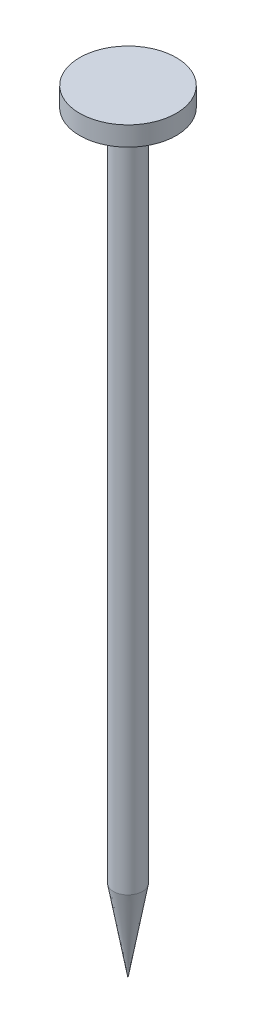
ISO-10303-21;
HEADER;
FILE_DESCRIPTION(('STEP AP214'),'2;1');
FILE_NAME('part.step','',(''),(''),'','','');
FILE_SCHEMA(('AUTOMOTIVE_DESIGN { 1 0 10303 214 1 1 1 1 }'));
ENDSEC;
DATA;
#1=APPLICATION_CONTEXT('core data for automotive mechanical design processes');
#2=APPLICATION_PROTOCOL_DEFINITION('international standard','automotive_design',2000,#1);
#3=PRODUCT_CONTEXT('',#1,'mechanical');
#4=PRODUCT('Part','Part','',(#3));
#5=PRODUCT_RELATED_PRODUCT_CATEGORY('part','',(#4));
#6=PRODUCT_DEFINITION_FORMATION('','',#4);
#7=PRODUCT_DEFINITION_CONTEXT('part definition',#1,'design');
#8=PRODUCT_DEFINITION('design','',#6,#7);
#9=PRODUCT_DEFINITION_SHAPE('','',#8);
#10=(LENGTH_UNIT() NAMED_UNIT(*) SI_UNIT(.MILLI.,.METRE.));
#11=(NAMED_UNIT(*) PLANE_ANGLE_UNIT() SI_UNIT($,.RADIAN.));
#12=(NAMED_UNIT(*) SI_UNIT($,.STERADIAN.) SOLID_ANGLE_UNIT());
#13=UNCERTAINTY_MEASURE_WITH_UNIT(LENGTH_MEASURE(1.E-05),#10,'distance_accuracy_value','');
#14=(GEOMETRIC_REPRESENTATION_CONTEXT(3) GLOBAL_UNCERTAINTY_ASSIGNED_CONTEXT((#13)) GLOBAL_UNIT_ASSIGNED_CONTEXT((#10,
#11,#12)) REPRESENTATION_CONTEXT('',''));
#15=CARTESIAN_POINT('',(0.,0.,0.));
#16=DIRECTION('',(0.,0.,1.));
#17=DIRECTION('',(1.,0.,0.));
#18=AXIS2_PLACEMENT_3D('',#15,#16,#17);
#19=CARTESIAN_POINT('',(0.,0.,0.));
#20=DIRECTION('',(0.,1.,0.));
#21=DIRECTION('',(0.,0.,1.));
#22=AXIS2_PLACEMENT_3D('',#19,#20,#21);
#23=CONICAL_SURFACE('',#22,0.,0.174532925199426);
#24=CARTESIAN_POINT('',(0.,4.25346136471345,0.));
#25=DIRECTION('',(0.,1.,0.));
#26=DIRECTION('',(0.,0.,1.));
#27=AXIS2_PLACEMENT_3D('',#24,#25,#26);
#28=CIRCLE('',#27,0.749999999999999);
#29=CARTESIAN_POINT('',(0.,4.25346136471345,0.749999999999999));
#30=VERTEX_POINT('',#29);
#31=EDGE_CURVE('E11',#30,#30,#28,.T.);
#32=ORIENTED_EDGE('',*,*,#31,.F.);
#33=EDGE_LOOP('',(#32));
#34=FACE_BOUND('',#33,.T.);
#35=CARTESIAN_POINT('',(0.,0.,0.));
#36=VERTEX_POINT('',#35);
#37=VERTEX_LOOP('',#36);
#38=FACE_BOUND('',#37,.T.);
#39=ADVANCED_FACE('F31',(#34,#38),#23,.T.);
#40=CARTESIAN_POINT('',(0.,0.,0.));
#41=DIRECTION('',(0.,1.,0.));
#42=DIRECTION('',(0.,0.,1.));
#43=AXIS2_PLACEMENT_3D('',#40,#41,#42);
#44=CYLINDRICAL_SURFACE('',#43,0.749999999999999);
#45=CARTESIAN_POINT('',(0.,39.,0.));
#46=DIRECTION('',(0.,1.,0.));
#47=DIRECTION('',(0.,0.,1.));
#48=AXIS2_PLACEMENT_3D('',#45,#46,#47);
#49=CIRCLE('',#48,0.749999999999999);
#50=CARTESIAN_POINT('',(0.,39.,0.749999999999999));
#51=VERTEX_POINT('',#50);
#52=EDGE_CURVE('E37',#51,#51,#49,.T.);
#53=ORIENTED_EDGE('',*,*,#52,.F.);
#54=EDGE_LOOP('',(#53));
#55=FACE_BOUND('',#54,.T.);
#56=ORIENTED_EDGE('',*,*,#31,.T.);
#57=EDGE_LOOP('',(#56));
#58=FACE_BOUND('',#57,.T.);
#59=ADVANCED_FACE('F41',(#55,#58),#44,.T.);
#60=CARTESIAN_POINT('',(0.749999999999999,39.,0.));
#61=DIRECTION('',(0.,1.,0.));
#62=DIRECTION('',(0.,0.,1.));
#63=AXIS2_PLACEMENT_3D('',#60,#61,#62);
#64=PLANE('',#63);
#65=CARTESIAN_POINT('',(0.,39.,0.));
#66=DIRECTION('',(0.,1.,0.));
#67=DIRECTION('',(0.,0.,1.));
#68=AXIS2_PLACEMENT_3D('',#65,#66,#67);
#69=CIRCLE('',#68,2.49999999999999);
#70=CARTESIAN_POINT('',(0.,39.,2.49999999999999));
#71=VERTEX_POINT('',#70);
#72=EDGE_CURVE('E69',#71,#71,#69,.T.);
#73=ORIENTED_EDGE('',*,*,#72,.F.);
#74=EDGE_LOOP('',(#73));
#75=FACE_BOUND('',#74,.T.);
#76=ORIENTED_EDGE('',*,*,#52,.T.);
#77=EDGE_LOOP('',(#76));
#78=FACE_BOUND('',#77,.T.);
#79=ADVANCED_FACE('F46',(#75,#78),#64,.F.);
#80=CARTESIAN_POINT('',(0.,0.,0.));
#81=DIRECTION('',(0.,1.,0.));
#82=DIRECTION('',(0.,0.,1.));
#83=AXIS2_PLACEMENT_3D('',#80,#81,#82);
#84=CYLINDRICAL_SURFACE('',#83,2.49999999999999);
#85=CARTESIAN_POINT('',(0.,40.,0.));
#86=DIRECTION('',(0.,1.,0.));
#87=DIRECTION('',(0.,0.,1.));
#88=AXIS2_PLACEMENT_3D('',#85,#86,#87);
#89=CIRCLE('',#88,2.49999999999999);
#90=CARTESIAN_POINT('',(0.,40.,2.49999999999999));
#91=VERTEX_POINT('',#90);
#92=EDGE_CURVE('E68',#91,#91,#89,.T.);
#93=ORIENTED_EDGE('',*,*,#92,.F.);
#94=EDGE_LOOP('',(#93));
#95=FACE_BOUND('',#94,.T.);
#96=ORIENTED_EDGE('',*,*,#72,.T.);
#97=EDGE_LOOP('',(#96));
#98=FACE_BOUND('',#97,.T.);
#99=ADVANCED_FACE('F53',(#95,#98),#84,.T.);
#100=CARTESIAN_POINT('',(2.49999999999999,40.,0.));
#101=DIRECTION('',(0.,-1.,0.));
#102=DIRECTION('',(0.,0.,-1.));
#103=AXIS2_PLACEMENT_3D('',#100,#101,#102);
#104=PLANE('',#103);
#105=ORIENTED_EDGE('',*,*,#92,.T.);
#106=EDGE_LOOP('',(#105));
#107=FACE_BOUND('',#106,.T.);
#108=ADVANCED_FACE('F60',(#107),#104,.F.);
#109=CLOSED_SHELL('',(#39,#59,#79,#99,#108));
#110=MANIFOLD_SOLID_BREP('B2',#109);
#111=ADVANCED_BREP_SHAPE_REPRESENTATION('',(#18,#110),#14);
#112=SHAPE_DEFINITION_REPRESENTATION(#9,#111);
ENDSEC;
END-ISO-10303-21;
